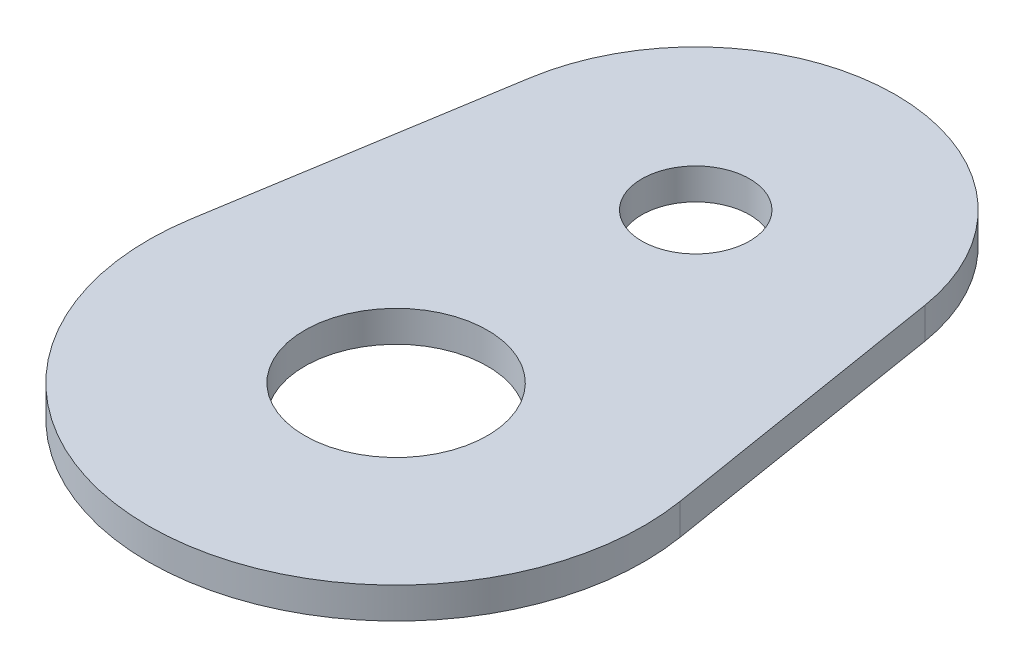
from build123d import *

# Parameters (mm, degrees)
EXTRUDE1_DEPTH     = 1.9812
SKETCH2_R          = 3.429
SKETCH2_R_2        = 5.81025
CUT_EXTRUDE1_DEPTH = 39.246901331


with BuildPart() as part:
    # Sketch1 → Extrude1 (new body)
    with BuildSketch(Plane(origin=(0, 0, 0), x_dir=(1, 0, 0), z_dir=(0, 1, 0))):
        with BuildLine():
            Line((12.536386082, 2.032), (15.545118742, -16.53032))
            ThreePointArc((15.545118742, -16.53032), (0, -34.798), (-15.545118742, -16.53032))
            Line((-15.545118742, -16.53032), (-12.536386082, 2.032))
            ThreePointArc((-12.536386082, 2.032), (0, 12.7), (12.536386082, 2.032))
        make_face()
    extrude(amount=EXTRUDE1_DEPTH)

    # Sketch2 → Cut-Extrude1 (cut, through all)
    with BuildSketch(Plane(origin=(0, 1.9812, 0), x_dir=(-1, 0, 0), z_dir=(0, 1, 0))):
        with Locations(Location((0, 0, 0), (0, 0, 90))):
            Circle(SKETCH2_R)
        with Locations(Location((0, 19.05, 0), (0, 0, 90))):
            Circle(SKETCH2_R_2)
    extrude(amount=-CUT_EXTRUDE1_DEPTH, mode=Mode.SUBTRACT)


solid = part.part
